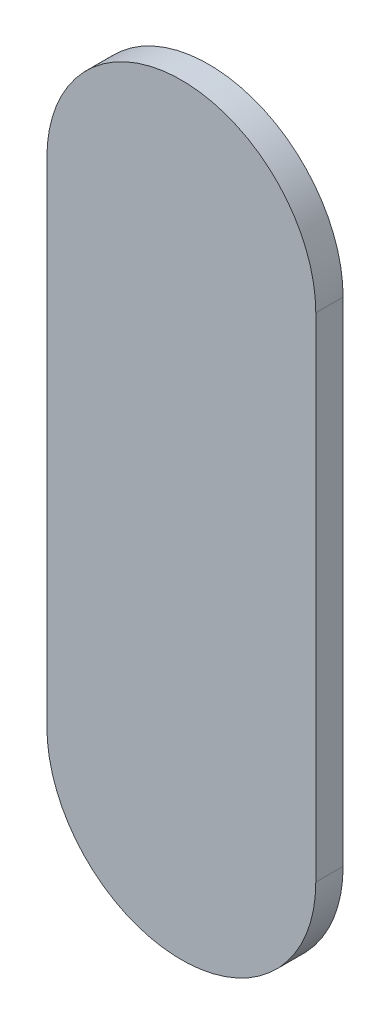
ISO-10303-21;
HEADER;
FILE_DESCRIPTION(('STEP AP214'),'2;1');
FILE_NAME('part.step','',(''),(''),'','','');
FILE_SCHEMA(('AUTOMOTIVE_DESIGN { 1 0 10303 214 1 1 1 1 }'));
ENDSEC;
DATA;
#1=APPLICATION_CONTEXT('core data for automotive mechanical design processes');
#2=APPLICATION_PROTOCOL_DEFINITION('international standard','automotive_design',2000,#1);
#3=PRODUCT_CONTEXT('',#1,'mechanical');
#4=PRODUCT('Part','Part','',(#3));
#5=PRODUCT_RELATED_PRODUCT_CATEGORY('part','',(#4));
#6=PRODUCT_DEFINITION_FORMATION('','',#4);
#7=PRODUCT_DEFINITION_CONTEXT('part definition',#1,'design');
#8=PRODUCT_DEFINITION('design','',#6,#7);
#9=PRODUCT_DEFINITION_SHAPE('','',#8);
#10=(LENGTH_UNIT() NAMED_UNIT(*) SI_UNIT(.MILLI.,.METRE.));
#11=(NAMED_UNIT(*) PLANE_ANGLE_UNIT() SI_UNIT($,.RADIAN.));
#12=(NAMED_UNIT(*) SI_UNIT($,.STERADIAN.) SOLID_ANGLE_UNIT());
#13=UNCERTAINTY_MEASURE_WITH_UNIT(LENGTH_MEASURE(1.E-05),#10,'distance_accuracy_value','');
#14=(GEOMETRIC_REPRESENTATION_CONTEXT(3) GLOBAL_UNCERTAINTY_ASSIGNED_CONTEXT((#13)) GLOBAL_UNIT_ASSIGNED_CONTEXT((#10,
#11,#12)) REPRESENTATION_CONTEXT('',''));
#15=CARTESIAN_POINT('',(0.,0.,0.));
#16=DIRECTION('',(0.,0.,1.));
#17=DIRECTION('',(1.,0.,0.));
#18=AXIS2_PLACEMENT_3D('',#15,#16,#17);
#19=CARTESIAN_POINT('',(13.35,15.35,-0.03048));
#20=DIRECTION('',(0.,0.,1.));
#21=DIRECTION('',(-1.,0.,0.));
#22=AXIS2_PLACEMENT_3D('',#19,#20,#21);
#23=CYLINDRICAL_SURFACE('',#22,0.15);
#24=CARTESIAN_POINT('',(13.35,15.35,0.));
#25=DIRECTION('',(0.,0.,-1.));
#26=DIRECTION('',(-1.,0.,0.));
#27=AXIS2_PLACEMENT_3D('',#24,#25,#26);
#28=CIRCLE('',#27,0.15);
#29=CARTESIAN_POINT('',(13.2,15.35,0.));
#30=VERTEX_POINT('',#29);
#31=CARTESIAN_POINT('',(13.5,15.35,0.));
#32=VERTEX_POINT('',#31);
#33=EDGE_CURVE('E111',#30,#32,#28,.T.);
#34=ORIENTED_EDGE('',*,*,#33,.T.);
#35=DIRECTION('',(0.,0.,-1.));
#36=VECTOR('',#35,1.);
#37=CARTESIAN_POINT('',(13.5,15.35,-0.01524));
#38=LINE('',#37,#36);
#39=CARTESIAN_POINT('',(13.5,15.35,-0.03048));
#40=VERTEX_POINT('',#39);
#41=EDGE_CURVE('E89',#32,#40,#38,.T.);
#42=ORIENTED_EDGE('',*,*,#41,.T.);
#43=CARTESIAN_POINT('',(13.35,15.35,-0.03048));
#44=DIRECTION('',(0.,0.,-1.));
#45=DIRECTION('',(-1.,0.,0.));
#46=AXIS2_PLACEMENT_3D('',#43,#44,#45);
#47=CIRCLE('',#46,0.15);
#48=CARTESIAN_POINT('',(13.2,15.35,-0.03048));
#49=VERTEX_POINT('',#48);
#50=EDGE_CURVE('E85',#49,#40,#47,.T.);
#51=ORIENTED_EDGE('',*,*,#50,.F.);
#52=DIRECTION('',(0.,0.,-1.));
#53=VECTOR('',#52,1.);
#54=CARTESIAN_POINT('',(13.2,15.35,-0.01524));
#55=LINE('',#54,#53);
#56=EDGE_CURVE('E11',#30,#49,#55,.T.);
#57=ORIENTED_EDGE('',*,*,#56,.F.);
#58=EDGE_LOOP('',(#34,#42,#51,#57));
#59=FACE_BOUND('',#58,.T.);
#60=ADVANCED_FACE('F17',(#59),#23,.T.);
#61=CARTESIAN_POINT('',(13.2,14.8,-0.03048));
#62=DIRECTION('',(1.,0.,0.));
#63=DIRECTION('',(0.,1.,0.));
#64=AXIS2_PLACEMENT_3D('',#61,#62,#63);
#65=PLANE('',#64);
#66=DIRECTION('',(0.,1.,0.));
#67=VECTOR('',#66,1.);
#68=CARTESIAN_POINT('',(13.2,15.075,0.));
#69=LINE('',#68,#67);
#70=CARTESIAN_POINT('',(13.2,14.8,0.));
#71=VERTEX_POINT('',#70);
#72=EDGE_CURVE('E76',#71,#30,#69,.T.);
#73=ORIENTED_EDGE('',*,*,#72,.T.);
#74=ORIENTED_EDGE('',*,*,#56,.T.);
#75=DIRECTION('',(0.,1.,0.));
#76=VECTOR('',#75,1.);
#77=CARTESIAN_POINT('',(13.2,14.8,-0.03048));
#78=LINE('',#77,#76);
#79=CARTESIAN_POINT('',(13.2,14.8,-0.03048));
#80=VERTEX_POINT('',#79);
#81=EDGE_CURVE('E73',#80,#49,#78,.T.);
#82=ORIENTED_EDGE('',*,*,#81,.F.);
#83=DIRECTION('',(0.,0.,-1.));
#84=VECTOR('',#83,1.);
#85=CARTESIAN_POINT('',(13.2,14.8,-0.01524));
#86=LINE('',#85,#84);
#87=EDGE_CURVE('E20',#71,#80,#86,.T.);
#88=ORIENTED_EDGE('',*,*,#87,.F.);
#89=EDGE_LOOP('',(#73,#74,#82,#88));
#90=FACE_BOUND('',#89,.T.);
#91=ADVANCED_FACE('F72',(#90),#65,.F.);
#92=CARTESIAN_POINT('',(13.35,14.8,-0.03048));
#93=DIRECTION('',(0.,0.,1.));
#94=DIRECTION('',(1.,0.,0.));
#95=AXIS2_PLACEMENT_3D('',#92,#93,#94);
#96=CYLINDRICAL_SURFACE('',#95,0.15);
#97=CARTESIAN_POINT('',(13.35,14.8,0.));
#98=DIRECTION('',(0.,0.,-1.));
#99=DIRECTION('',(1.,0.,0.));
#100=AXIS2_PLACEMENT_3D('',#97,#98,#99);
#101=CIRCLE('',#100,0.15);
#102=CARTESIAN_POINT('',(13.5,14.8,0.));
#103=VERTEX_POINT('',#102);
#104=EDGE_CURVE('E99',#103,#71,#101,.T.);
#105=ORIENTED_EDGE('',*,*,#104,.T.);
#106=ORIENTED_EDGE('',*,*,#87,.T.);
#107=CARTESIAN_POINT('',(13.35,14.8,-0.03048));
#108=DIRECTION('',(0.,0.,-1.));
#109=DIRECTION('',(1.,0.,0.));
#110=AXIS2_PLACEMENT_3D('',#107,#108,#109);
#111=CIRCLE('',#110,0.15);
#112=CARTESIAN_POINT('',(13.5,14.8,-0.03048));
#113=VERTEX_POINT('',#112);
#114=EDGE_CURVE('E86',#113,#80,#111,.T.);
#115=ORIENTED_EDGE('',*,*,#114,.F.);
#116=DIRECTION('',(0.,0.,-1.));
#117=VECTOR('',#116,1.);
#118=CARTESIAN_POINT('',(13.5,14.8,-0.01524));
#119=LINE('',#118,#117);
#120=EDGE_CURVE('E47',#103,#113,#119,.T.);
#121=ORIENTED_EDGE('',*,*,#120,.F.);
#122=EDGE_LOOP('',(#105,#106,#115,#121));
#123=FACE_BOUND('',#122,.T.);
#124=ADVANCED_FACE('F117',(#123),#96,.T.);
#125=CARTESIAN_POINT('',(13.5,15.35,-0.03048));
#126=DIRECTION('',(-1.,0.,0.));
#127=DIRECTION('',(0.,0.,1.));
#128=AXIS2_PLACEMENT_3D('',#125,#126,#127);
#129=PLANE('',#128);
#130=DIRECTION('',(0.,-1.,0.));
#131=VECTOR('',#130,1.);
#132=CARTESIAN_POINT('',(13.5,15.075,0.));
#133=LINE('',#132,#131);
#134=EDGE_CURVE('E92',#32,#103,#133,.T.);
#135=ORIENTED_EDGE('',*,*,#134,.T.);
#136=ORIENTED_EDGE('',*,*,#120,.T.);
#137=DIRECTION('',(0.,-1.,0.));
#138=VECTOR('',#137,1.);
#139=CARTESIAN_POINT('',(13.5,15.35,-0.03048));
#140=LINE('',#139,#138);
#141=EDGE_CURVE('E91',#40,#113,#140,.T.);
#142=ORIENTED_EDGE('',*,*,#141,.F.);
#143=ORIENTED_EDGE('',*,*,#41,.F.);
#144=EDGE_LOOP('',(#135,#136,#142,#143));
#145=FACE_BOUND('',#144,.T.);
#146=ADVANCED_FACE('F121',(#145),#129,.F.);
#147=CARTESIAN_POINT('',(13.35,15.075,-0.03048));
#148=DIRECTION('',(0.,0.,1.));
#149=DIRECTION('',(1.,0.,0.));
#150=AXIS2_PLACEMENT_3D('',#147,#148,#149);
#151=PLANE('',#150);
#152=ORIENTED_EDGE('',*,*,#50,.T.);
#153=ORIENTED_EDGE('',*,*,#141,.T.);
#154=ORIENTED_EDGE('',*,*,#114,.T.);
#155=ORIENTED_EDGE('',*,*,#81,.T.);
#156=EDGE_LOOP('',(#152,#153,#154,#155));
#157=FACE_BOUND('',#156,.T.);
#158=ADVANCED_FACE('F83',(#157),#151,.F.);
#159=CARTESIAN_POINT('',(13.35,15.075,0.));
#160=DIRECTION('',(0.,0.,1.));
#161=DIRECTION('',(1.,0.,0.));
#162=AXIS2_PLACEMENT_3D('',#159,#160,#161);
#163=PLANE('',#162);
#164=ORIENTED_EDGE('',*,*,#33,.F.);
#165=ORIENTED_EDGE('',*,*,#72,.F.);
#166=ORIENTED_EDGE('',*,*,#104,.F.);
#167=ORIENTED_EDGE('',*,*,#134,.F.);
#168=EDGE_LOOP('',(#164,#165,#166,#167));
#169=FACE_BOUND('',#168,.T.);
#170=ADVANCED_FACE('F120',(#169),#163,.T.);
#171=CLOSED_SHELL('',(#60,#91,#124,#146,#158,#170));
#172=MANIFOLD_SOLID_BREP('B1',#171);
#173=ADVANCED_BREP_SHAPE_REPRESENTATION('',(#18,#172),#14);
#174=SHAPE_DEFINITION_REPRESENTATION(#9,#173);
ENDSEC;
END-ISO-10303-21;
